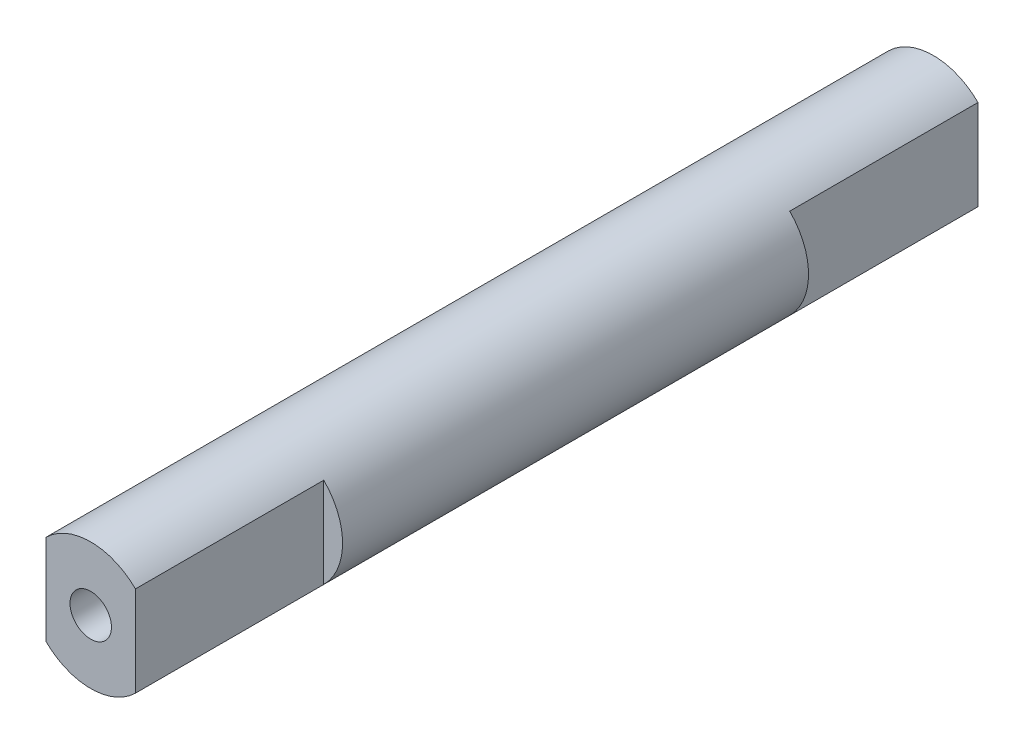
from build123d import *

# Parameters (mm, degrees)
SKETCH1_R               = 2.7
EXTRUDE1_DEPTH          = 0.5
EXTRUDE2_DEPTH          = 8
P_IDAT_START            = 18.796
SKICA1_R                = 2.7
P_IDAT_VYSUNUT_M1_DEPTH = 18.796
SKETCH3_R               = 0.88
CUT_EXTRUDE1_DEPTH      = 36.999077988


with BuildPart() as part:
    # Sketch1 → Extrude1 (new body)
    with BuildSketch(Plane.XY):
        Circle(SKETCH1_R)
    extrude1 = extrude(amount=EXTRUDE1_DEPTH)

    # Sketch2 → Extrude2 (add)
    with BuildSketch(Plane.XY.offset(0.5)):
        with BuildLine():
            Line((1.9, -1.918332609), (1.9, 1.918332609))
            ThreePointArc((1.9, 1.918332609), (0, 2.7), (-1.9, 1.918332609))
            Line((-1.9, 1.918332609), (-1.9, -1.918332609))
            ThreePointArc((-1.9, -1.918332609), (0, -2.7), (1.9, -1.918332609))
        make_face()
    extrude2 = extrude(amount=EXTRUDE2_DEPTH)

    # Skica1 → P_idat vysunut_m1 (add)
    with BuildSketch(Plane(origin=(0, 0, 0), x_dir=(-1, 0, 0), z_dir=(0, 0, -1)).offset(P_IDAT_START)):
        Circle(SKICA1_R)
    extrude(amount=-P_IDAT_VYSUNUT_M1_DEPTH)

    # Zrcadlit4: Extrude1, Extrude2 across plane
    add(extrude1.mirror(Plane.XY.offset(-9.398)))
    add(extrude2.mirror(Plane.XY.offset(-9.398)))

    # Sketch3 → Cut-Extrude1 (cut, through all)
    with BuildSketch(Plane.XY.offset(8.5)):
        Circle(SKETCH3_R)
    extrude(amount=-CUT_EXTRUDE1_DEPTH, mode=Mode.SUBTRACT)


solid = part.part
